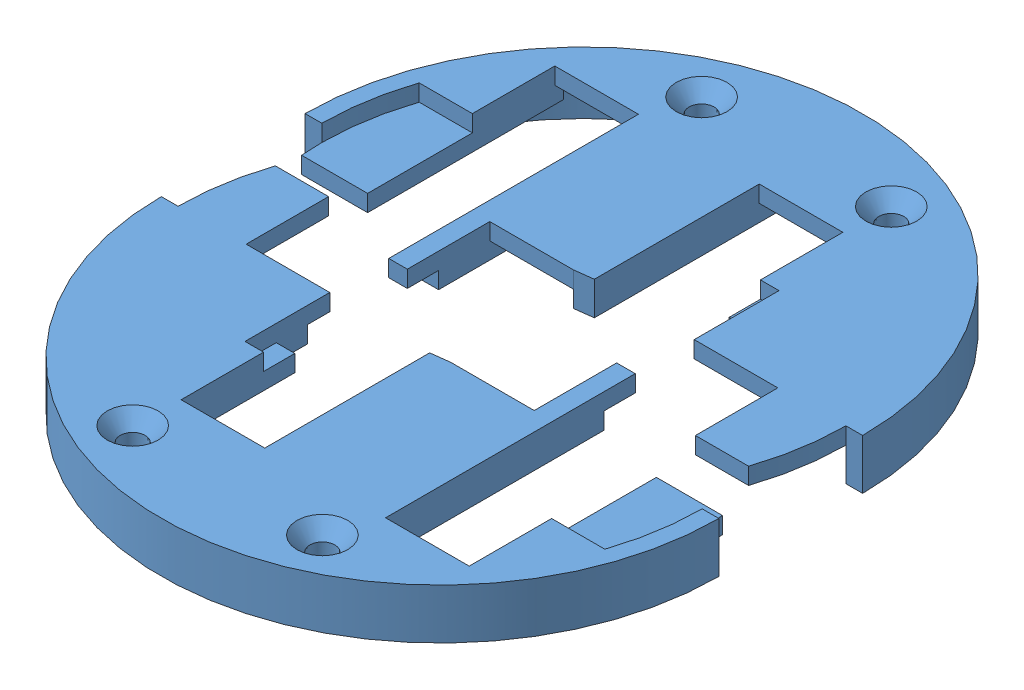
SolidWorks assembly block_a2.SLDASM, configuration Default (file format 5000). Lengths in mm.
Overall size (100 9 125.78).
2 component instances, 1 part files, 2 mates.
Components (placement in the parent):
- a2_split-1: a2_split.SLDPRT [Default] at (9.2682 13.5892 -14.123) size (100 9 65)
- a2_split-2: a2_split.SLDPRT [Default] at (9.2682 13.5892 11.6609) x (-1 0 0) z (0 0 -1) size (100 9 65)
Mates (geometry in assembly coordinates):
- Coincident1: coincident aligned: plane of a2_split-1 through (7.6015 15.0892 15.6613) normal (-1 0 0); plane of a2_split-2 through (7.6015 15.0892 11.8737) normal (-1 0 0)
- Coincident2: coincident aligned: plane of a2_split-1 through (9.2682 15.0892 -14.123) normal (0 1 0); plane of a2_split-2 through (9.2682 15.0892 11.6609) normal (0 1 0)
